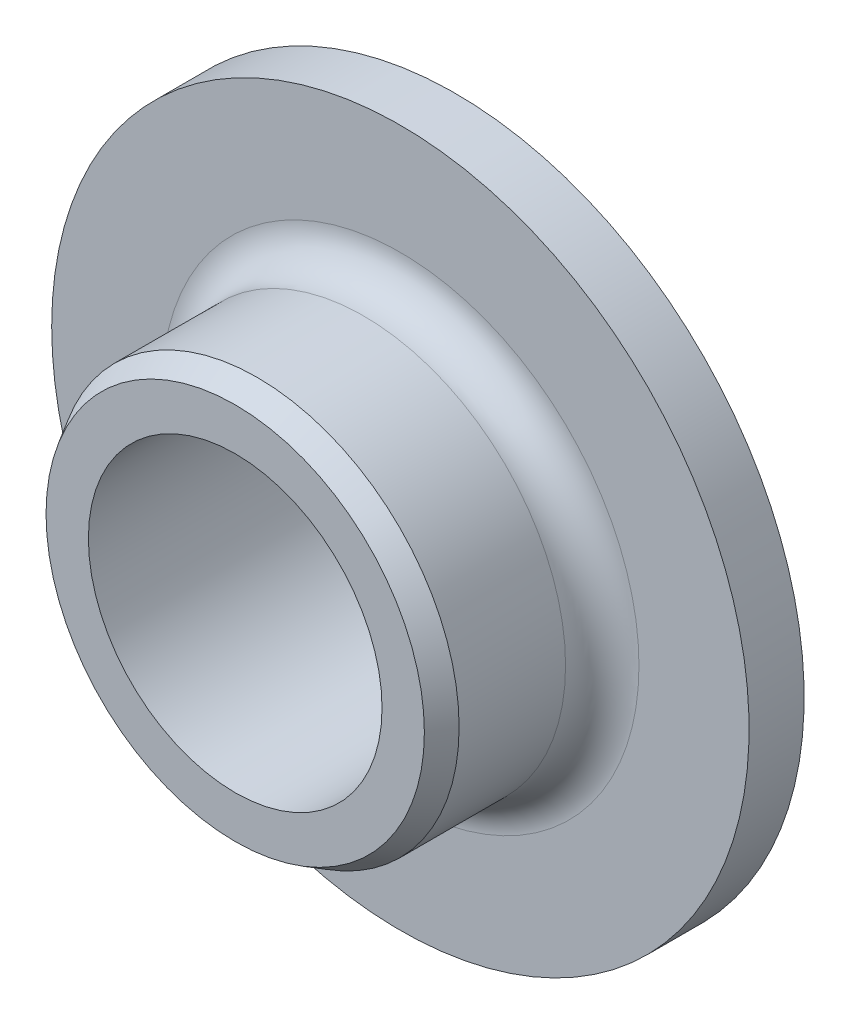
ISO-10303-21;
HEADER;
FILE_DESCRIPTION(('STEP AP214'),'2;1');
FILE_NAME('part.step','',(''),(''),'','','');
FILE_SCHEMA(('AUTOMOTIVE_DESIGN { 1 0 10303 214 1 1 1 1 }'));
ENDSEC;
DATA;
#1=APPLICATION_CONTEXT('core data for automotive mechanical design processes');
#2=APPLICATION_PROTOCOL_DEFINITION('international standard','automotive_design',2000,#1);
#3=PRODUCT_CONTEXT('',#1,'mechanical');
#4=PRODUCT('Part','Part','',(#3));
#5=PRODUCT_RELATED_PRODUCT_CATEGORY('part','',(#4));
#6=PRODUCT_DEFINITION_FORMATION('','',#4);
#7=PRODUCT_DEFINITION_CONTEXT('part definition',#1,'design');
#8=PRODUCT_DEFINITION('design','',#6,#7);
#9=PRODUCT_DEFINITION_SHAPE('','',#8);
#10=(LENGTH_UNIT() NAMED_UNIT(*) SI_UNIT(.MILLI.,.METRE.));
#11=(NAMED_UNIT(*) PLANE_ANGLE_UNIT() SI_UNIT($,.RADIAN.));
#12=(NAMED_UNIT(*) SI_UNIT($,.STERADIAN.) SOLID_ANGLE_UNIT());
#13=UNCERTAINTY_MEASURE_WITH_UNIT(LENGTH_MEASURE(1.E-05),#10,'distance_accuracy_value','');
#14=(GEOMETRIC_REPRESENTATION_CONTEXT(3) GLOBAL_UNCERTAINTY_ASSIGNED_CONTEXT((#13)) GLOBAL_UNIT_ASSIGNED_CONTEXT((#10,
#11,#12)) REPRESENTATION_CONTEXT('',''));
#15=CARTESIAN_POINT('',(0.,0.,0.));
#16=DIRECTION('',(0.,0.,1.));
#17=DIRECTION('',(1.,0.,0.));
#18=AXIS2_PLACEMENT_3D('',#15,#16,#17);
#19=CARTESIAN_POINT('',(0.,0.,1.975));
#20=DIRECTION('',(0.,0.,-1.));
#21=DIRECTION('',(-1.,0.,0.));
#22=AXIS2_PLACEMENT_3D('',#19,#20,#21);
#23=CYLINDRICAL_SURFACE('',#22,2.75);
#24=CARTESIAN_POINT('',(0.,0.,2.70000000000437));
#25=DIRECTION('',(0.,0.,-1.));
#26=DIRECTION('',(1.,0.,0.));
#27=AXIS2_PLACEMENT_3D('',#24,#25,#26);
#28=CIRCLE('',#27,2.75000000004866);
#29=CARTESIAN_POINT('',(2.75000000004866,0.,2.70000000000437));
#30=VERTEX_POINT('',#29);
#31=EDGE_CURVE('E41',#30,#30,#28,.F.);
#32=ORIENTED_EDGE('',*,*,#31,.F.);
#33=EDGE_LOOP('',(#32));
#34=FACE_BOUND('',#33,.T.);
#35=CARTESIAN_POINT('',(0.,0.,1.25));
#36=DIRECTION('',(0.,0.,1.));
#37=DIRECTION('',(1.,0.,0.));
#38=AXIS2_PLACEMENT_3D('',#35,#36,#37);
#39=CIRCLE('',#38,2.75);
#40=CARTESIAN_POINT('',(2.75,0.,1.25));
#41=VERTEX_POINT('',#40);
#42=EDGE_CURVE('E85',#41,#41,#39,.T.);
#43=ORIENTED_EDGE('',*,*,#42,.T.);
#44=EDGE_LOOP('',(#43));
#45=FACE_BOUND('',#44,.T.);
#46=ADVANCED_FACE('F17',(#34,#45),#23,.T.);
#47=CARTESIAN_POINT('',(0.,0.,1.25));
#48=DIRECTION('',(0.,0.,1.));
#49=DIRECTION('',(1.,0.,0.));
#50=AXIS2_PLACEMENT_3D('',#47,#48,#49);
#51=TOROIDAL_SURFACE('',#50,3.25,0.500000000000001);
#52=CARTESIAN_POINT('',(0.,0.,0.749999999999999));
#53=DIRECTION('',(0.,0.,1.));
#54=DIRECTION('',(-1.,0.,0.));
#55=AXIS2_PLACEMENT_3D('',#52,#53,#54);
#56=CIRCLE('',#55,3.25);
#57=CARTESIAN_POINT('',(3.25,0.,0.749999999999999));
#58=VERTEX_POINT('',#57);
#59=CARTESIAN_POINT('',(-3.25,0.,0.749999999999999));
#60=VERTEX_POINT('',#59);
#61=EDGE_CURVE('E33',#58,#60,#56,.F.);
#62=ORIENTED_EDGE('',*,*,#61,.F.);
#63=CARTESIAN_POINT('',(0.,0.,0.749999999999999));
#64=DIRECTION('',(0.,0.,1.));
#65=DIRECTION('',(1.,0.,0.));
#66=AXIS2_PLACEMENT_3D('',#63,#64,#65);
#67=CIRCLE('',#66,3.25);
#68=EDGE_CURVE('E36',#60,#58,#67,.F.);
#69=ORIENTED_EDGE('',*,*,#68,.F.);
#70=EDGE_LOOP('',(#62,#69));
#71=FACE_BOUND('',#70,.T.);
#72=ORIENTED_EDGE('',*,*,#42,.F.);
#73=EDGE_LOOP('',(#72));
#74=FACE_BOUND('',#73,.T.);
#75=ADVANCED_FACE('F37',(#71,#74),#51,.F.);
#76=CARTESIAN_POINT('',(0.,0.,2.70000000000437));
#77=DIRECTION('',(0.,0.,-1.));
#78=DIRECTION('',(-1.,0.,0.));
#79=AXIS2_PLACEMENT_3D('',#76,#77,#78);
#80=CONICAL_SURFACE('',#79,2.75000000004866,0.52359877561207);
#81=CARTESIAN_POINT('',(0.,0.,3.00000000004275));
#82=DIRECTION('',(0.,0.,-1.));
#83=DIRECTION('',(-1.,0.,0.));
#84=AXIS2_PLACEMENT_3D('',#81,#82,#83);
#85=CIRCLE('',#84,2.5767949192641);
#86=CARTESIAN_POINT('',(-2.5767949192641,0.,3.00000000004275));
#87=VERTEX_POINT('',#86);
#88=EDGE_CURVE('E45',#87,#87,#85,.F.);
#89=ORIENTED_EDGE('',*,*,#88,.F.);
#90=EDGE_LOOP('',(#89));
#91=FACE_BOUND('',#90,.T.);
#92=ORIENTED_EDGE('',*,*,#31,.T.);
#93=EDGE_LOOP('',(#92));
#94=FACE_BOUND('',#93,.T.);
#95=ADVANCED_FACE('F65',(#91,#94),#80,.T.);
#96=CARTESIAN_POINT('',(4.,0.,0.75));
#97=DIRECTION('',(0.,0.,1.));
#98=DIRECTION('',(1.,0.,0.));
#99=AXIS2_PLACEMENT_3D('',#96,#97,#98);
#100=PLANE('',#99);
#101=CARTESIAN_POINT('',(0.,0.,0.75));
#102=DIRECTION('',(0.,0.,-1.));
#103=DIRECTION('',(-1.,0.,0.));
#104=AXIS2_PLACEMENT_3D('',#101,#102,#103);
#105=CIRCLE('',#104,4.75);
#106=CARTESIAN_POINT('',(-4.75,0.,0.75));
#107=VERTEX_POINT('',#106);
#108=EDGE_CURVE('E93',#107,#107,#105,.T.);
#109=ORIENTED_EDGE('',*,*,#108,.F.);
#110=EDGE_LOOP('',(#109));
#111=FACE_BOUND('',#110,.T.);
#112=ORIENTED_EDGE('',*,*,#68,.T.);
#113=ORIENTED_EDGE('',*,*,#61,.T.);
#114=EDGE_LOOP('',(#112,#113));
#115=FACE_BOUND('',#114,.T.);
#116=ADVANCED_FACE('F44',(#111,#115),#100,.T.);
#117=CARTESIAN_POINT('',(2.28839745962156,0.,3.));
#118=DIRECTION('',(0.,0.,1.));
#119=DIRECTION('',(1.,0.,0.));
#120=AXIS2_PLACEMENT_3D('',#117,#118,#119);
#121=PLANE('',#120);
#122=ORIENTED_EDGE('',*,*,#88,.T.);
#123=EDGE_LOOP('',(#122));
#124=FACE_BOUND('',#123,.T.);
#125=CARTESIAN_POINT('',(0.,0.,3.));
#126=DIRECTION('',(0.,0.,-1.));
#127=DIRECTION('',(-1.,0.,0.));
#128=AXIS2_PLACEMENT_3D('',#125,#126,#127);
#129=CIRCLE('',#128,2.);
#130=CARTESIAN_POINT('',(-2.,0.,3.));
#131=VERTEX_POINT('',#130);
#132=EDGE_CURVE('E90',#131,#131,#129,.T.);
#133=ORIENTED_EDGE('',*,*,#132,.T.);
#134=EDGE_LOOP('',(#133));
#135=FACE_BOUND('',#134,.T.);
#136=ADVANCED_FACE('F64',(#124,#135),#121,.T.);
#137=CARTESIAN_POINT('',(0.,0.,0.375));
#138=DIRECTION('',(0.,0.,-1.));
#139=DIRECTION('',(-1.,0.,0.));
#140=AXIS2_PLACEMENT_3D('',#137,#138,#139);
#141=CYLINDRICAL_SURFACE('',#140,4.75);
#142=ORIENTED_EDGE('',*,*,#108,.T.);
#143=EDGE_LOOP('',(#142));
#144=FACE_BOUND('',#143,.T.);
#145=CARTESIAN_POINT('',(0.,0.,0.));
#146=DIRECTION('',(0.,0.,-1.));
#147=DIRECTION('',(-1.,0.,0.));
#148=AXIS2_PLACEMENT_3D('',#145,#146,#147);
#149=CIRCLE('',#148,4.75);
#150=CARTESIAN_POINT('',(-4.75,0.,0.));
#151=VERTEX_POINT('',#150);
#152=EDGE_CURVE('E26',#151,#151,#149,.T.);
#153=ORIENTED_EDGE('',*,*,#152,.F.);
#154=EDGE_LOOP('',(#153));
#155=FACE_BOUND('',#154,.T.);
#156=ADVANCED_FACE('F116',(#144,#155),#141,.T.);
#157=CARTESIAN_POINT('',(0.,0.,1.5));
#158=DIRECTION('',(0.,0.,-1.));
#159=DIRECTION('',(-1.,0.,0.));
#160=AXIS2_PLACEMENT_3D('',#157,#158,#159);
#161=CYLINDRICAL_SURFACE('',#160,2.);
#162=CARTESIAN_POINT('',(0.,0.,0.));
#163=DIRECTION('',(0.,0.,-1.));
#164=DIRECTION('',(-1.,0.,0.));
#165=AXIS2_PLACEMENT_3D('',#162,#163,#164);
#166=CIRCLE('',#165,2.);
#167=CARTESIAN_POINT('',(-2.,0.,0.));
#168=VERTEX_POINT('',#167);
#169=EDGE_CURVE('E11',#168,#168,#166,.F.);
#170=ORIENTED_EDGE('',*,*,#169,.F.);
#171=EDGE_LOOP('',(#170));
#172=FACE_BOUND('',#171,.T.);
#173=ORIENTED_EDGE('',*,*,#132,.F.);
#174=EDGE_LOOP('',(#173));
#175=FACE_BOUND('',#174,.T.);
#176=ADVANCED_FACE('F110',(#172,#175),#161,.F.);
#177=CARTESIAN_POINT('',(3.375,0.,0.));
#178=DIRECTION('',(0.,0.,-1.));
#179=DIRECTION('',(-1.,0.,0.));
#180=AXIS2_PLACEMENT_3D('',#177,#178,#179);
#181=PLANE('',#180);
#182=ORIENTED_EDGE('',*,*,#169,.T.);
#183=EDGE_LOOP('',(#182));
#184=FACE_BOUND('',#183,.T.);
#185=ORIENTED_EDGE('',*,*,#152,.T.);
#186=EDGE_LOOP('',(#185));
#187=FACE_BOUND('',#186,.T.);
#188=ADVANCED_FACE('F108',(#184,#187),#181,.T.);
#189=CLOSED_SHELL('',(#46,#75,#95,#116,#136,#156,#176,#188));
#190=MANIFOLD_SOLID_BREP('B1',#189);
#191=ADVANCED_BREP_SHAPE_REPRESENTATION('',(#18,#190),#14);
#192=SHAPE_DEFINITION_REPRESENTATION(#9,#191);
ENDSEC;
END-ISO-10303-21;
